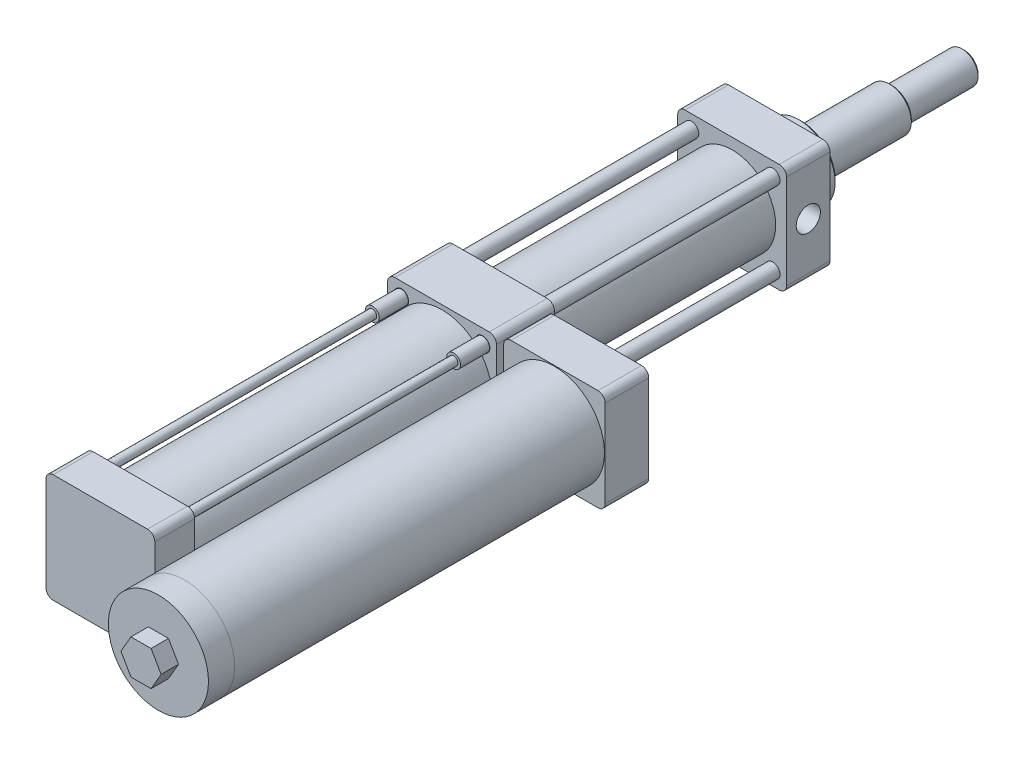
from build123d import *

# Parameters (mm, degrees)
SKETCH_1_R            = 5
EXTRUDE_1_DEPTH       = 30
SKETCH_2_R            = 25
EXTRUDE_2_DEPTH       = 18
SKETCH_3_R            = 15
EXTRUDE_3_DEPTH       = 62
SKETCH_4_R            = 11
EXTRUDE_4_DEPTH       = 50
CHAMFER_1_SIZE        = 2
CHAMFER_2_SIZE        = 1.5
SKETCH_5_R            = 30
EXTRUDE_5_DEPTH       = 160
SKETCH_6_R            = 5
EXTRUDE_6_DEPTH       = 40
SKETCH_7_R            = 34.5
EXTRUDE_7_DEPTH       = 208
SKETCH_8_R            = 4.75
EXTRUDE_8_DEPTH       = 20
EXTRUDE_8_2_DEPTH     = 20
EXTRUDE_8_3_DEPTH     = 20
EXTRUDE_8_4_DEPTH     = 20
EXTRUDE_9_DEPTH       = 27.5
EXTRUDE_10_DEPTH      = 30
SKETCH_11_R           = 34.5
EXTRUDE_11_DEPTH      = 255
SKETCH_12_R           = 34.5
EXTRUDE_12_DEPTH      = 18
EXTRUDE_13_DEPTH      = 12
SKETCH_14_R           = 3
EXTRUDE_14_DEPTH      = 188
SKETCH_15_R           = 5
EXTRUDE_15_DEPTH      = 190
EXTRUDE_15_2_DEPTH    = 190
EXTRUDE_15_3_DEPTH    = 190
EXTRUDE_15_4_DEPTH    = 190
F_3_8_RC_1_AT_2_COUNT = 2
F_3_8_RC_1_AT_2_PITCH = 241.75


with BuildPart() as part:
    # Sketch 1 → Extrude 1 (new body)
    with BuildSketch(Plane.XY):
        with BuildLine():
            Line((32.5, 37.5), (-32.5, 37.5))
            ThreePointArc((-32.5, 37.5), (-36.035533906, 36.035533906), (-37.5, 32.5))
            Line((-37.5, 32.5), (-37.5, -32.5))
            ThreePointArc((-37.5, -32.5), (-36.035533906, -36.035533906), (-32.5, -37.5))
            Line((-32.5, -37.5), (32.5, -37.5))
            ThreePointArc((32.5, -37.5), (36.035533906, -36.035533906), (37.5, -32.5))
            Line((37.5, -32.5), (37.5, 32.5))
            ThreePointArc((37.5, 32.5), (36.035533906, 36.035533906), (32.5, 37.5))
        make_face()
        with Locations((28, -28)):
            Circle(SKETCH_1_R, mode=Mode.SUBTRACT)
        with Locations((-28, -28)):
            Circle(SKETCH_1_R, mode=Mode.SUBTRACT)
        with Locations((-28, 28)):
            Circle(SKETCH_1_R, mode=Mode.SUBTRACT)
        with Locations((28, 28)):
            Circle(SKETCH_1_R, mode=Mode.SUBTRACT)
    extrude(amount=EXTRUDE_1_DEPTH)

    # Sketch 2 → Extrude 2 (add)
    with BuildSketch(Plane(origin=(0, 0, 0), x_dir=(-1, 0, 0), z_dir=(0, 0, -1))):
        with Locations(Location((0, 0, 0), (0, 0, 180))):
            Circle(SKETCH_2_R)
    extrude(amount=EXTRUDE_2_DEPTH)

    # Sketch 3 → Extrude 3 (add)
    with BuildSketch(Plane(origin=(0, 0, -18), x_dir=(-1, 0, 0), z_dir=(0, 0, -1))):
        Circle(SKETCH_3_R)
    extrude(amount=EXTRUDE_3_DEPTH)

    # Sketch 4 → Extrude 4 (add)
    with BuildSketch(Plane(origin=(0, 0, -80), x_dir=(-1, 0, 0), z_dir=(0, 0, -1))):
        Circle(SKETCH_4_R)
    extrude(amount=EXTRUDE_4_DEPTH)

    # Chamfer 1
    chamfer_1_edges = [part.edges().sort_by_distance(p)[0] for p in [
        (-25, 0, -18),
    ]]
    chamfer(chamfer_1_edges, length=CHAMFER_1_SIZE)

    # Chamfer 2
    chamfer_2_edges = [part.edges().sort_by_distance(p)[0] for p in [
        (15, 0, -80),
        (11, 0, -130),
    ]]
    chamfer(chamfer_2_edges, length=CHAMFER_2_SIZE)

    # Sketch 5 → Extrude 5 (add)
    with BuildSketch(Plane.XY.offset(30)):
        Circle(SKETCH_5_R)
    extrude(amount=EXTRUDE_5_DEPTH)

    # Sketch 6 → Extrude 6 (add)
    with BuildSketch(Plane.XY.offset(190)):
        with BuildLine():
            Line((-32.5, -37.5), (32.5, -37.5))
            ThreePointArc((32.5, -37.5), (36.035533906, -36.035533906), (37.5, -32.5))
            Line((37.5, -32.5), (37.5, 32.5))
            ThreePointArc((37.5, 32.5), (36.035533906, 36.035533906), (32.5, 37.5))
            Line((32.5, 37.5), (-32.5, 37.5))
            ThreePointArc((-32.5, 37.5), (-36.035533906, 36.035533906), (-37.5, 32.5))
            Line((-37.5, 32.5), (-37.5, -32.5))
            ThreePointArc((-37.5, -32.5), (-36.035533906, -36.035533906), (-32.5, -37.5))
        make_face()
        with Locations((-28, -28)):
            Circle(SKETCH_6_R, mode=Mode.SUBTRACT)
        with Locations((-28, 28)):
            Circle(SKETCH_6_R, mode=Mode.SUBTRACT)
        with Locations((28, -28)):
            Circle(SKETCH_6_R, mode=Mode.SUBTRACT)
        with Locations((28, 28)):
            Circle(SKETCH_6_R, mode=Mode.SUBTRACT)
    extrude(amount=EXTRUDE_6_DEPTH)

    # Sketch 7 → Extrude 7 (add)
    with BuildSketch(Plane.XY.offset(230)):
        with Locations(Location((0, 0, 0), (0, 0, 180))):
            Circle(SKETCH_7_R)
    extrude(amount=EXTRUDE_7_DEPTH)

    # Sketch 9 → Extrude 9 (add)
    with BuildSketch(Plane.XY.offset(438)):
        with BuildLine():
            Line((-32.5, -37.5), (32.5, -37.5))
            ThreePointArc((32.5, -37.5), (36.035533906, -36.035533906), (37.5, -32.5))
            Line((37.5, -32.5), (37.5, 32.5))
            ThreePointArc((37.5, 32.5), (36.035533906, 36.035533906), (32.5, 37.5))
            Line((32.5, 37.5), (-32.5, 37.5))
            ThreePointArc((-32.5, 37.5), (-36.035533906, 36.035533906), (-37.5, 32.5))
            Line((-37.5, 32.5), (-37.5, -32.5))
            ThreePointArc((-37.5, -32.5), (-36.035533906, -36.035533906), (-32.5, -37.5))
        make_face()
    extrude(amount=EXTRUDE_9_DEPTH)

    # Sketch 10 → Extrude 10 (add)
    with BuildSketch(Plane(origin=(0, 0, 195), x_dir=(-1, 0, 0), z_dir=(0, 0, -1))):
        with BuildLine():
            Line((-102.5, 35), (-42.5, 35))
            ThreePointArc((-42.5, 35), (-38.964466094, 33.535533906), (-37.5, 30))
            Line((-37.5, 30), (-37.5, -30))
            ThreePointArc((-37.5, -30), (-38.964466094, -33.535533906), (-42.5, -35))
            Line((-42.5, -35), (-102.5, -35))
            ThreePointArc((-102.5, -35), (-106.035533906, -33.535533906), (-107.5, -30))
            Line((-107.5, -30), (-107.5, 30))
            ThreePointArc((-107.5, 30), (-106.035533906, 33.535533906), (-102.5, 35))
        make_face()
    extrude(amount=-EXTRUDE_10_DEPTH)

    # Sketch 11 → Extrude 11 (add)
    with BuildSketch(Plane.XY.offset(225)):
        with Locations((72.5, 0)):
            Circle(SKETCH_11_R)
    extrude(amount=EXTRUDE_11_DEPTH)



with BuildPart() as body_2:
    # Sketch 8 → Extrude 8 (new body)
    with BuildSketch(Plane.XY.offset(230)):
        with Locations((28, 28)):
            Circle(SKETCH_8_R)
    extrude(amount=EXTRUDE_8_DEPTH)


with BuildPart() as body_3:
    # Sketch 8 → Extrude 8 2 (new body)
    with BuildSketch(Plane.XY.offset(230)):
        with Locations((28, -28)):
            Circle(SKETCH_8_R)
    extrude(amount=EXTRUDE_8_2_DEPTH)


with BuildPart() as body_4:
    # Sketch 8 → Extrude 8 3 (new body)
    with BuildSketch(Plane.XY.offset(230)):
        with Locations((-28, 28)):
            Circle(SKETCH_8_R)
    extrude(amount=EXTRUDE_8_3_DEPTH)


with BuildPart() as body_5:
    # Sketch 8 → Extrude 8 4 (new body)
    with BuildSketch(Plane.XY.offset(230)):
        with Locations((-28, -28)):
            Circle(SKETCH_8_R)
    extrude(amount=EXTRUDE_8_4_DEPTH)


with BuildPart() as body_6:
    # Sketch 12 → Extrude 12 (new body)
    with BuildSketch(Plane.XY.offset(480)):
        with Locations((72.5, 0)):
            Circle(SKETCH_12_R)
    extrude(amount=EXTRUDE_12_DEPTH)

    # Sketch 13 → Extrude 13 (add)
    with BuildSketch(Plane.XY.offset(498)):
        Polygon((86.356406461, 0), (79.42820323, 12), (65.57179677, 12), (58.643593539, 0), (65.57179677, -12), (79.42820323, -12), align=None)
    extrude(amount=EXTRUDE_13_DEPTH)


with BuildPart() as part_1:
    add(part.part)

    add(body_2.part)  # Extrude 14 merges body 2

    add(body_3.part)  # Extrude 14 merges body 3

    add(body_4.part)  # Extrude 14 merges body 4

    add(body_5.part)  # Extrude 14 merges body 5
    # Sketch 14 → Extrude 14 (add)
    with BuildSketch(Plane.XY.offset(250)):
        with Locations(Location((28, 28, 0), (0, 0, 180))):
            Circle(SKETCH_14_R)
        with Locations(Location((-28, 28, 0), (0, 0, 180))):
            Circle(SKETCH_14_R)
        with Locations(Location((-28, -28, 0), (0, 0, 180))):
            Circle(SKETCH_14_R)
        with Locations(Location((28, -28, 0), (0, 0, 180))):
            Circle(SKETCH_14_R)
    extrude(amount=EXTRUDE_14_DEPTH)

    # Sketch 17 → 3_8 Rc _1 (revolve, cut)
    with BuildSketch(Plane(origin=(0, -37.5, 451.75), x_dir=(0, 0, -1), z_dir=(1, 0, 0))):
        Polygon((0, 0), (0, 22.386153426), (7.15, 18.09), (7.15, 11.4), (7.97513052, 11.4), (8.331, 0), align=None)
    f_3_8_rc_1 = revolve(axis=Axis((0, -43.85, 451.75), (0, 1, 0)), mode=Mode.SUBTRACT)

    # 3_8 Rc _1 at 2: 3_8 Rc _1 ×2
    with Locations(*[(0, 0, -i * F_3_8_RC_1_AT_2_PITCH) for i in range(1, F_3_8_RC_1_AT_2_COUNT)]):
        add(f_3_8_rc_1, mode=Mode.SUBTRACT)

    # Sketch 19 → 3_8 Rc _2 (revolve, cut)
    with BuildSketch(Plane(origin=(37.5, 0, 15), x_dir=(0, 0, -1), z_dir=(0, 1, 0))):
        Polygon((0, 0), (0, 22.386153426), (7.15, 18.09), (7.15, 11.4), (7.97513052, 11.4), (8.331, 0), align=None)
    revolve(axis=Axis((43.85, 0, 15), (-1, 0, 0)), mode=Mode.SUBTRACT)


with BuildPart() as body_3_2:
    # Sketch 15 → Extrude 15 (new body)
    with BuildSketch(Plane(origin=(0, 0, 0), x_dir=(-1, 0, 0), z_dir=(0, 0, -1))):
        with Locations((28, 28)):
            Circle(SKETCH_15_R)
    extrude(amount=-EXTRUDE_15_DEPTH)


with BuildPart() as body_4_2:
    # Sketch 15 → Extrude 15 2 (new body)
    with BuildSketch(Plane(origin=(0, 0, 0), x_dir=(-1, 0, 0), z_dir=(0, 0, -1))):
        with Locations((28, -28)):
            Circle(SKETCH_15_R)
    extrude(amount=-EXTRUDE_15_2_DEPTH)


with BuildPart() as body_5_2:
    # Sketch 15 → Extrude 15 3 (new body)
    with BuildSketch(Plane(origin=(0, 0, 0), x_dir=(-1, 0, 0), z_dir=(0, 0, -1))):
        with Locations((-28, 28)):
            Circle(SKETCH_15_R)
    extrude(amount=-EXTRUDE_15_3_DEPTH)


with BuildPart() as body_6_2:
    # Sketch 15 → Extrude 15 4 (new body)
    with BuildSketch(Plane(origin=(0, 0, 0), x_dir=(-1, 0, 0), z_dir=(0, 0, -1))):
        with Locations((-28, -28)):
            Circle(SKETCH_15_R)
    extrude(amount=-EXTRUDE_15_4_DEPTH)


solid = Compound([body_6.part, part_1.part, body_3_2.part, body_4_2.part, body_5_2.part, body_6_2.part])
